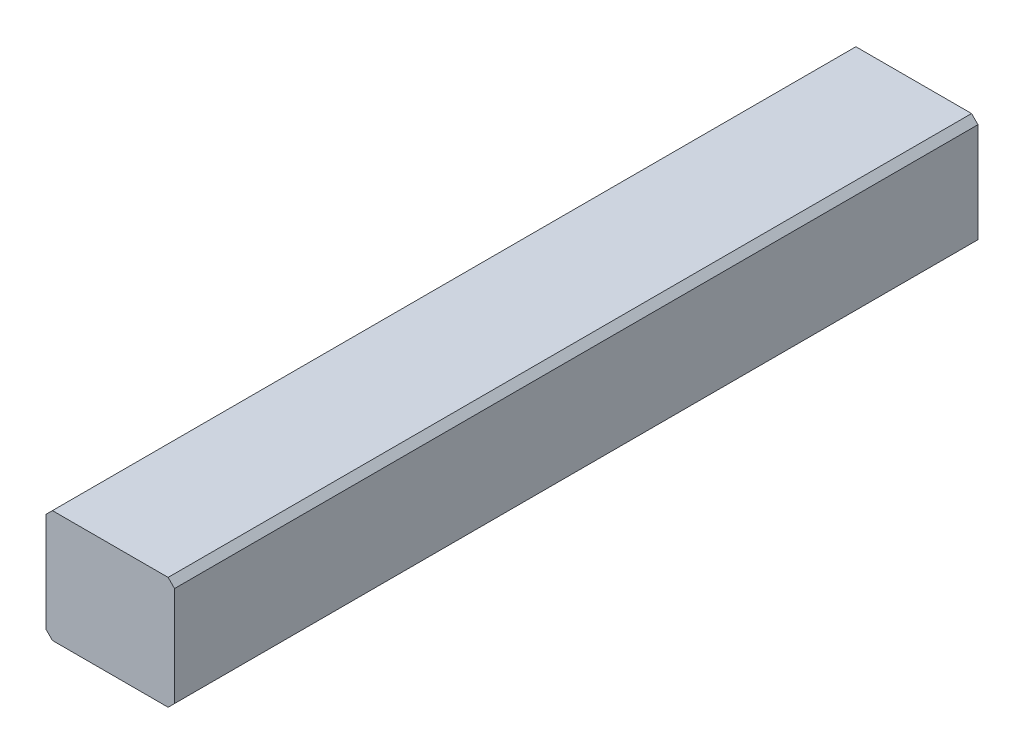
from build123d import *

# Parameters (mm, degrees)
BODY_W         = 8
BODY_H         = 7
EXTRUDE1_DEPTH = 50
CHAMFER1_SIZE  = 0.4


with BuildPart() as part:
    # body → Extrude1 (new body)
    with BuildSketch(Plane.XY):
        with Locations((4, 3.5)):
            Rectangle(BODY_W, BODY_H)
    extrude(amount=EXTRUDE1_DEPTH)

    # Chamfer1
    chamfer1_edges = [part.edges().sort_by_distance(p)[0] for p in [
        (0, 7, 25),
        (8, 7, 25),
        (8, 0, 25),
        (0, 0, 25),
    ]]
    chamfer(chamfer1_edges, length=CHAMFER1_SIZE)


solid = part.part
